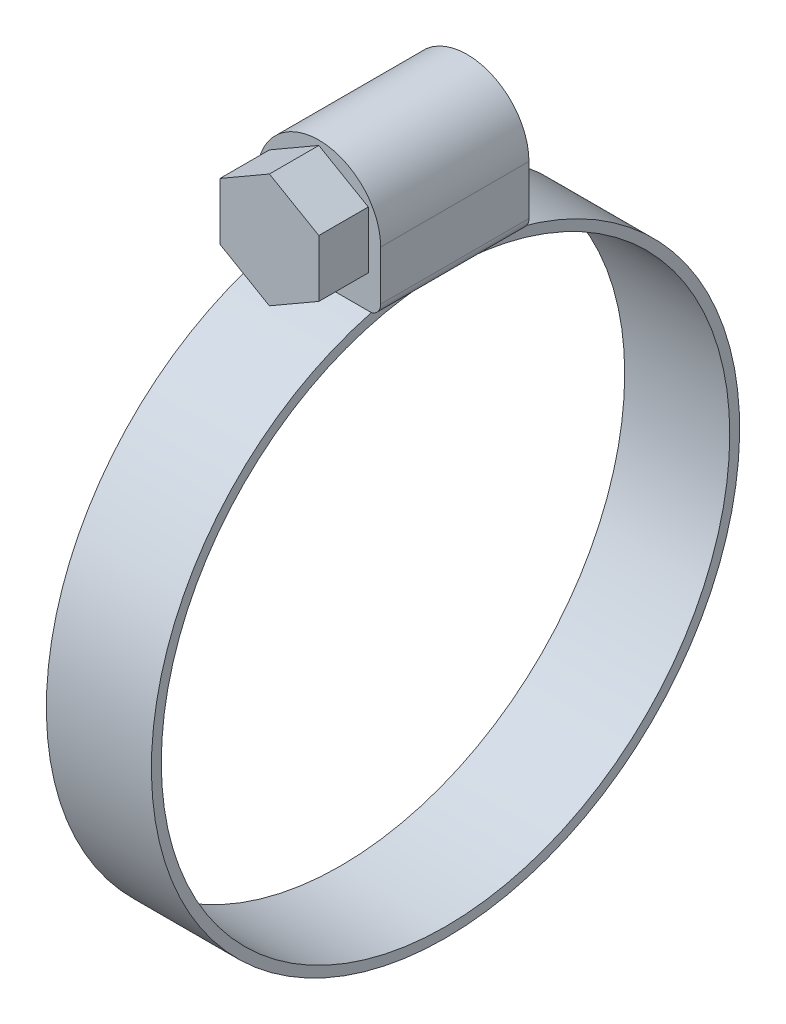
ISO-10303-21;
HEADER;
FILE_DESCRIPTION(('STEP AP214'),'2;1');
FILE_NAME('part.step','',(''),(''),'','','');
FILE_SCHEMA(('AUTOMOTIVE_DESIGN { 1 0 10303 214 1 1 1 1 }'));
ENDSEC;
DATA;
#1=APPLICATION_CONTEXT('core data for automotive mechanical design processes');
#2=APPLICATION_PROTOCOL_DEFINITION('international standard','automotive_design',2000,#1);
#3=PRODUCT_CONTEXT('',#1,'mechanical');
#4=PRODUCT('Part','Part','',(#3));
#5=PRODUCT_RELATED_PRODUCT_CATEGORY('part','',(#4));
#6=PRODUCT_DEFINITION_FORMATION('','',#4);
#7=PRODUCT_DEFINITION_CONTEXT('part definition',#1,'design');
#8=PRODUCT_DEFINITION('design','',#6,#7);
#9=PRODUCT_DEFINITION_SHAPE('','',#8);
#10=(LENGTH_UNIT() NAMED_UNIT(*) SI_UNIT(.MILLI.,.METRE.));
#11=(NAMED_UNIT(*) PLANE_ANGLE_UNIT() SI_UNIT($,.RADIAN.));
#12=(NAMED_UNIT(*) SI_UNIT($,.STERADIAN.) SOLID_ANGLE_UNIT());
#13=UNCERTAINTY_MEASURE_WITH_UNIT(LENGTH_MEASURE(1.E-05),#10,'distance_accuracy_value','');
#14=(GEOMETRIC_REPRESENTATION_CONTEXT(3) GLOBAL_UNCERTAINTY_ASSIGNED_CONTEXT((#13)) GLOBAL_UNIT_ASSIGNED_CONTEXT((#10,
#11,#12)) REPRESENTATION_CONTEXT('',''));
#15=CARTESIAN_POINT('',(0.,0.,0.));
#16=DIRECTION('',(0.,0.,1.));
#17=DIRECTION('',(1.,0.,0.));
#18=AXIS2_PLACEMENT_3D('',#15,#16,#17);
#19=CARTESIAN_POINT('',(4.24999999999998,28.,6.));
#20=DIRECTION('',(0.,0.,1.));
#21=DIRECTION('',(1.,0.,0.));
#22=AXIS2_PLACEMENT_3D('',#19,#20,#21);
#23=PLANE('',#22);
#24=DIRECTION('',(-1.,0.,0.));
#25=VECTOR('',#24,1.);
#26=CARTESIAN_POINT('',(0.,23.0312830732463,6.));
#27=LINE('',#26,#25);
#28=CARTESIAN_POINT('',(8.4981683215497,23.0312830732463,6.));
#29=VERTEX_POINT('',#28);
#30=CARTESIAN_POINT('',(0.00183167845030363,23.0312830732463,6.));
#31=VERTEX_POINT('',#30);
#32=EDGE_CURVE('E40',#29,#31,#27,.T.);
#33=ORIENTED_EDGE('',*,*,#32,.F.);
#34=CARTESIAN_POINT('',(8.24999999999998,24.,6.));
#35=DIRECTION('',(0.,0.,1.));
#36=DIRECTION('',(1.,0.,0.));
#37=AXIS2_PLACEMENT_3D('',#34,#35,#36);
#38=CIRCLE('',#37,1.);
#39=CARTESIAN_POINT('',(9.24999999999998,24.,6.));
#40=VERTEX_POINT('',#39);
#41=EDGE_CURVE('E180',#29,#40,#38,.T.);
#42=ORIENTED_EDGE('',*,*,#41,.T.);
#43=DIRECTION('',(0.,1.,0.));
#44=VECTOR('',#43,1.);
#45=CARTESIAN_POINT('',(9.24999999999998,24.,6.));
#46=LINE('',#45,#44);
#47=CARTESIAN_POINT('',(9.24999999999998,28.,6.));
#48=VERTEX_POINT('',#47);
#49=EDGE_CURVE('E182',#40,#48,#46,.T.);
#50=ORIENTED_EDGE('',*,*,#49,.T.);
#51=CARTESIAN_POINT('',(4.24999999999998,28.,6.));
#52=DIRECTION('',(0.,0.,1.));
#53=DIRECTION('',(1.,0.,0.));
#54=AXIS2_PLACEMENT_3D('',#51,#52,#53);
#55=CIRCLE('',#54,5.);
#56=CARTESIAN_POINT('',(-0.749999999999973,28.,6.));
#57=VERTEX_POINT('',#56);
#58=EDGE_CURVE('E171',#48,#57,#55,.T.);
#59=ORIENTED_EDGE('',*,*,#58,.T.);
#60=DIRECTION('',(0.,-1.,0.));
#61=VECTOR('',#60,1.);
#62=CARTESIAN_POINT('',(-0.749999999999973,28.,6.));
#63=LINE('',#62,#61);
#64=CARTESIAN_POINT('',(-0.749999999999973,24.,6.));
#65=VERTEX_POINT('',#64);
#66=EDGE_CURVE('E174',#57,#65,#63,.T.);
#67=ORIENTED_EDGE('',*,*,#66,.T.);
#68=CARTESIAN_POINT('',(0.250000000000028,24.,6.));
#69=DIRECTION('',(0.,0.,1.));
#70=DIRECTION('',(1.,0.,0.));
#71=AXIS2_PLACEMENT_3D('',#68,#69,#70);
#72=CIRCLE('',#71,1.);
#73=EDGE_CURVE('E177',#65,#31,#72,.T.);
#74=ORIENTED_EDGE('',*,*,#73,.T.);
#75=EDGE_LOOP('',(#33,#42,#50,#59,#67,#74));
#76=FACE_BOUND('',#75,.T.);
#77=DIRECTION('',(0.,1.,0.));
#78=VECTOR('',#77,1.);
#79=CARTESIAN_POINT('',(8.24999999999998,25.6905989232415,6.00000000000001));
#80=LINE('',#79,#78);
#81=CARTESIAN_POINT('',(8.24999999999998,25.6905989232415,6.00000000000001));
#82=VERTEX_POINT('',#81);
#83=CARTESIAN_POINT('',(8.24999999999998,30.3094010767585,6.00000000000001));
#84=VERTEX_POINT('',#83);
#85=EDGE_CURVE('E432',#82,#84,#80,.T.);
#86=ORIENTED_EDGE('',*,*,#85,.F.);
#87=DIRECTION('',(0.866025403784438,0.5,0.));
#88=VECTOR('',#87,1.);
#89=CARTESIAN_POINT('',(4.25000000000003,23.381197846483,6.00000000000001));
#90=LINE('',#89,#88);
#91=CARTESIAN_POINT('',(4.25000000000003,23.381197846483,6.00000000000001));
#92=VERTEX_POINT('',#91);
#93=EDGE_CURVE('E160',#92,#82,#90,.T.);
#94=ORIENTED_EDGE('',*,*,#93,.F.);
#95=DIRECTION('',(0.866025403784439,-0.5,0.));
#96=VECTOR('',#95,1.);
#97=CARTESIAN_POINT('',(0.250000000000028,25.6905989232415,6.00000000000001));
#98=LINE('',#97,#96);
#99=CARTESIAN_POINT('',(0.250000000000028,25.6905989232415,6.00000000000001));
#100=VERTEX_POINT('',#99);
#101=EDGE_CURVE('E156',#100,#92,#98,.T.);
#102=ORIENTED_EDGE('',*,*,#101,.F.);
#103=DIRECTION('',(0.,-1.,0.));
#104=VECTOR('',#103,1.);
#105=CARTESIAN_POINT('',(0.250000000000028,30.3094010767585,6.00000000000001));
#106=LINE('',#105,#104);
#107=CARTESIAN_POINT('',(0.250000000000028,30.3094010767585,6.00000000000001));
#108=VERTEX_POINT('',#107);
#109=EDGE_CURVE('E428',#108,#100,#106,.T.);
#110=ORIENTED_EDGE('',*,*,#109,.F.);
#111=DIRECTION('',(-0.866025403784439,-0.5,0.));
#112=VECTOR('',#111,1.);
#113=CARTESIAN_POINT('',(4.24999999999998,32.618802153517,6.00000000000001));
#114=LINE('',#113,#112);
#115=CARTESIAN_POINT('',(4.24999999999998,32.618802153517,6.00000000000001));
#116=VERTEX_POINT('',#115);
#117=EDGE_CURVE('E440',#116,#108,#114,.T.);
#118=ORIENTED_EDGE('',*,*,#117,.F.);
#119=DIRECTION('',(-0.866025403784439,0.5,0.));
#120=VECTOR('',#119,1.);
#121=CARTESIAN_POINT('',(8.24999999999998,30.3094010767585,6.00000000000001));
#122=LINE('',#121,#120);
#123=EDGE_CURVE('E434',#84,#116,#122,.T.);
#124=ORIENTED_EDGE('',*,*,#123,.F.);
#125=EDGE_LOOP('',(#86,#94,#102,#110,#118,#124));
#126=FACE_BOUND('',#125,.T.);
#127=ADVANCED_FACE('F36',(#76,#126),#23,.T.);
#128=CARTESIAN_POINT('',(0.,23.8,0.));
#129=DIRECTION('',(1.,0.,0.));
#130=DIRECTION('',(0.,0.,-1.));
#131=AXIS2_PLACEMENT_3D('',#128,#129,#130);
#132=PLANE('',#131);
#133=CARTESIAN_POINT('',(0.,0.,0.));
#134=DIRECTION('',(-1.,0.,0.));
#135=DIRECTION('',(0.,0.,1.));
#136=AXIS2_PLACEMENT_3D('',#133,#134,#135);
#137=CIRCLE('',#136,23.);
#138=CARTESIAN_POINT('',(0.,0.,23.));
#139=VERTEX_POINT('',#138);
#140=EDGE_CURVE('E218',#139,#139,#137,.T.);
#141=ORIENTED_EDGE('',*,*,#140,.F.);
#142=EDGE_LOOP('',(#141));
#143=FACE_BOUND('',#142,.T.);
#144=DIRECTION('',(0.,0.,-1.));
#145=VECTOR('',#144,1.);
#146=CARTESIAN_POINT('',(0.,23.0317541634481,6.));
#147=LINE('',#146,#145);
#148=CARTESIAN_POINT('',(0.,23.0317541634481,-5.99819140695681));
#149=VERTEX_POINT('',#148);
#150=CARTESIAN_POINT('',(0.,23.0317541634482,5.99819140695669));
#151=VERTEX_POINT('',#150);
#152=EDGE_CURVE('E206',#149,#151,#147,.F.);
#153=ORIENTED_EDGE('',*,*,#152,.F.);
#154=CARTESIAN_POINT('',(0.,0.,0.));
#155=DIRECTION('',(-1.,0.,0.));
#156=DIRECTION('',(0.,0.,1.));
#157=AXIS2_PLACEMENT_3D('',#154,#155,#156);
#158=CIRCLE('',#157,23.8);
#159=EDGE_CURVE('E209',#149,#151,#158,.T.);
#160=ORIENTED_EDGE('',*,*,#159,.T.);
#161=EDGE_LOOP('',(#153,#160));
#162=FACE_BOUND('',#161,.T.);
#163=ADVANCED_FACE('F38',(#143,#162),#132,.F.);
#164=CARTESIAN_POINT('',(8.50000000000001,23.8,0.));
#165=DIRECTION('',(-1.,0.,0.));
#166=DIRECTION('',(0.,0.,1.));
#167=AXIS2_PLACEMENT_3D('',#164,#165,#166);
#168=PLANE('',#167);
#169=CARTESIAN_POINT('',(8.50000000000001,0.,0.));
#170=DIRECTION('',(-1.,0.,0.));
#171=DIRECTION('',(0.,0.,1.));
#172=AXIS2_PLACEMENT_3D('',#169,#170,#171);
#173=CIRCLE('',#172,23.);
#174=CARTESIAN_POINT('',(8.50000000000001,0.,23.));
#175=VERTEX_POINT('',#174);
#176=EDGE_CURVE('E215',#175,#175,#173,.T.);
#177=ORIENTED_EDGE('',*,*,#176,.T.);
#178=EDGE_LOOP('',(#177));
#179=FACE_BOUND('',#178,.T.);
#180=DIRECTION('',(0.,0.,-1.));
#181=VECTOR('',#180,1.);
#182=CARTESIAN_POINT('',(8.50000000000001,23.0317541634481,6.));
#183=LINE('',#182,#181);
#184=CARTESIAN_POINT('',(8.50000000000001,23.0317541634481,5.9981914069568));
#185=VERTEX_POINT('',#184);
#186=CARTESIAN_POINT('',(8.50000000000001,23.0317541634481,-5.9981914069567));
#187=VERTEX_POINT('',#186);
#188=EDGE_CURVE('E203',#185,#187,#183,.T.);
#189=ORIENTED_EDGE('',*,*,#188,.F.);
#190=CARTESIAN_POINT('',(8.50000000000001,0.,0.));
#191=DIRECTION('',(-1.,0.,0.));
#192=DIRECTION('',(0.,0.,1.));
#193=AXIS2_PLACEMENT_3D('',#190,#191,#192);
#194=CIRCLE('',#193,23.8);
#195=EDGE_CURVE('E212',#187,#185,#194,.T.);
#196=ORIENTED_EDGE('',*,*,#195,.F.);
#197=EDGE_LOOP('',(#189,#196));
#198=FACE_BOUND('',#197,.T.);
#199=ADVANCED_FACE('F269',(#179,#198),#168,.F.);
#200=CARTESIAN_POINT('',(0.,0.,0.));
#201=DIRECTION('',(-1.,0.,0.));
#202=DIRECTION('',(0.,0.,1.));
#203=AXIS2_PLACEMENT_3D('',#200,#201,#202);
#204=CYLINDRICAL_SURFACE('',#203,23.8);
#205=CARTESIAN_POINT('',(0.00183167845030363,23.0312830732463,-6.));
#206=CARTESIAN_POINT('',(-0.0110917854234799,23.0345980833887,-5.98727592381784));
#207=CARTESIAN_POINT('',(-0.0234489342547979,23.0380348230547,-5.97403986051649));
#208=CARTESIAN_POINT('',(-0.0471519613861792,23.0450889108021,-5.94676996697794));
#209=CARTESIAN_POINT('',(-0.0584993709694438,23.0487059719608,-5.93273739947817));
#210=CARTESIAN_POINT('',(-0.0911464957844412,23.0597096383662,-5.88987747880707));
#211=CARTESIAN_POINT('',(-0.11118834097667,23.0672859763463,-5.86014525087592));
#212=CARTESIAN_POINT('',(-0.148399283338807,23.0825716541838,-5.79964208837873));
#213=CARTESIAN_POINT('',(-0.16560649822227,23.0902773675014,-5.7688930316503));
#214=CARTESIAN_POINT('',(-0.198057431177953,23.1058144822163,-5.70634543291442));
#215=CARTESIAN_POINT('',(-0.213297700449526,23.1136460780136,-5.67454516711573));
#216=CARTESIAN_POINT('',(-0.249474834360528,23.1333165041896,-5.59393880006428));
#217=CARTESIAN_POINT('',(-0.269385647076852,23.1451752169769,-5.54467985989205));
#218=CARTESIAN_POINT('',(-0.306412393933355,23.1688062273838,-5.44509369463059));
#219=CARTESIAN_POINT('',(-0.323526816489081,23.1805784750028,-5.39476590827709));
#220=CARTESIAN_POINT('',(-0.371585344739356,23.2156393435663,-5.24260520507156));
#221=CARTESIAN_POINT('',(-0.399215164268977,23.2386546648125,-5.13966615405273));
#222=CARTESIAN_POINT('',(-0.448929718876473,23.2840149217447,-4.93015112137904));
#223=CARTESIAN_POINT('',(-0.470894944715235,23.3063378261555,-4.82354341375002));
#224=CARTESIAN_POINT('',(-0.510195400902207,23.3496490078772,-4.60931895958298));
#225=CARTESIAN_POINT('',(-0.527534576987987,23.3706384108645,-4.50170315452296));
#226=CARTESIAN_POINT('',(-0.558542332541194,23.4110183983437,-4.28673170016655));
#227=CARTESIAN_POINT('',(-0.572244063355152,23.4304222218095,-4.17938320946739));
#228=CARTESIAN_POINT('',(-0.596913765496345,23.4678009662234,-3.96412106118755));
#229=CARTESIAN_POINT('',(-0.607881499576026,23.4857757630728,-3.85620735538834));
#230=CARTESIAN_POINT('',(-0.637529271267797,23.5375194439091,-3.53173536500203));
#231=CARTESIAN_POINT('',(-0.652943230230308,23.569092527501,-3.31452646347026));
#232=CARTESIAN_POINT('',(-0.67806862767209,23.6262985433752,-2.8786199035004));
#233=CARTESIAN_POINT('',(-0.687769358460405,23.6519202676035,-2.65992022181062));
#234=CARTESIAN_POINT('',(-0.703318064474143,23.6970894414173,-2.22180893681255));
#235=CARTESIAN_POINT('',(-0.709166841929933,23.7166381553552,-2.00239749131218));
#236=CARTESIAN_POINT('',(-0.718264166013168,23.7494987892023,-1.5649330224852));
#237=CARTESIAN_POINT('',(-0.721534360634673,23.7628622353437,-1.34688427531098));
#238=CARTESIAN_POINT('',(-0.726358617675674,23.7835818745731,-0.910470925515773));
#239=CARTESIAN_POINT('',(-0.727912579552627,23.7909377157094,-0.692106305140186));
#240=CARTESIAN_POINT('',(-0.729730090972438,23.7996295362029,-0.25547413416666));
#241=CARTESIAN_POINT('',(-0.729994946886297,23.8009716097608,-0.0372067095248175));
#242=CARTESIAN_POINT('',(-0.729315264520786,23.7976513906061,0.399268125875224));
#243=CARTESIAN_POINT('',(-0.72837080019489,23.7929894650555,0.617475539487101));
#244=CARTESIAN_POINT('',(-0.725168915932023,23.7784274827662,1.03199698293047));
#245=CARTESIAN_POINT('',(-0.723051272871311,23.7690939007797,1.22833214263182));
#246=CARTESIAN_POINT('',(-0.717166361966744,23.7455654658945,1.62072827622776));
#247=CARTESIAN_POINT('',(-0.713398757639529,23.7313696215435,1.81678918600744));
#248=CARTESIAN_POINT('',(-0.703487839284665,23.6980641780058,2.20922746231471));
#249=CARTESIAN_POINT('',(-0.697335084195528,23.6789351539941,2.405602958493));
#250=CARTESIAN_POINT('',(-0.681614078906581,23.6358276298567,2.79759055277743));
#251=CARTESIAN_POINT('',(-0.672047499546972,23.611851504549,2.99320297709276));
#252=CARTESIAN_POINT('',(-0.64794577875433,23.5589171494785,3.38477366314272));
#253=CARTESIAN_POINT('',(-0.63337867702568,23.5299274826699,3.58072587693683));
#254=CARTESIAN_POINT('',(-0.606078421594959,23.4828402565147,3.87376218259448));
#255=CARTESIAN_POINT('',(-0.596057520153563,23.4665262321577,3.97138788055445));
#256=CARTESIAN_POINT('',(-0.573780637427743,23.4327283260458,4.16617452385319));
#257=CARTESIAN_POINT('',(-0.56152489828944,23.4152445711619,4.26333551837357));
#258=CARTESIAN_POINT('',(-0.534289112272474,23.3791942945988,4.45678439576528));
#259=CARTESIAN_POINT('',(-0.519316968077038,23.3606310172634,4.55307398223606));
#260=CARTESIAN_POINT('',(-0.485904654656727,23.3224377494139,4.74483387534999));
#261=CARTESIAN_POINT('',(-0.467465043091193,23.302807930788,4.84030431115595));
#262=CARTESIAN_POINT('',(-0.426122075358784,23.2626486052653,5.02976446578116));
#263=CARTESIAN_POINT('',(-0.403232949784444,23.2421221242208,5.12375789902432));
#264=CARTESIAN_POINT('',(-0.351356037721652,23.2003136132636,5.30984947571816));
#265=CARTESIAN_POINT('',(-0.322375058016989,23.1790324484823,5.4019496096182));
#266=CARTESIAN_POINT('',(-0.275448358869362,23.1490299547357,5.52845365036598));
#267=CARTESIAN_POINT('',(-0.261321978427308,23.1404379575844,5.56430290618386));
#268=CARTESIAN_POINT('',(-0.231270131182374,23.1232553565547,5.63528105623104));
#269=CARTESIAN_POINT('',(-0.215343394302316,23.1146647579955,5.67040942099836));
#270=CARTESIAN_POINT('',(-0.181428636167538,23.0976551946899,5.73930068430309));
#271=CARTESIAN_POINT('',(-0.163460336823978,23.0892353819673,5.77307298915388));
#272=CARTESIAN_POINT('',(-0.124764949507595,23.0726403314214,5.8390426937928));
#273=CARTESIAN_POINT('',(-0.10404160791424,23.0644647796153,5.8712421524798));
#274=CARTESIAN_POINT('',(-0.0689290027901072,23.0521279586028,5.91943525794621));
#275=CARTESIAN_POINT('',(-0.0557975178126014,23.0477919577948,5.93629220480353));
#276=CARTESIAN_POINT('',(-0.0281040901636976,23.0393413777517,5.96900665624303));
#277=CARTESIAN_POINT('',(-0.013534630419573,23.0352281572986,5.98485811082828));
#278=CARTESIAN_POINT('',(0.00183167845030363,23.0312830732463,5.99999999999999));
#279=B_SPLINE_CURVE_WITH_KNOTS('',3,(#205,#206,#207,#208,#209,#210,#211,#212,#213,#214,#215,
#216,#217,#218,#219,#220,#221,#222,#223,#224,#225,#226,#227,#228,#229,#230,#231,#232,#233,#234,
#235,#236,#237,#238,#239,#240,#241,#242,#243,#244,#245,#246,#247,#248,#249,#250,#251,#252,#253,
#254,#255,#256,#257,#258,#259,#260,#261,#262,#263,#264,#265,#266,#267,#268,#269,#270,#271,#272,
#273,#274,#275,#276,#277,#278),.UNSPECIFIED.,.F.,.F.,(4,2,2,2,2,2,2,2,2,2,2,2,2,2,2,2,2,2,2,2,2,
2,2,2,2,2,2,2,2,2,2,2,2,2,2,2,4),(0.,0.0552610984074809,0.110436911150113,0.220188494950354,
0.328316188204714,0.436630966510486,0.599825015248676,0.763106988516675,1.08990715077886,
1.423123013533,1.75605374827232,2.08583702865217,2.4156489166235,3.07551946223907,
3.73662282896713,4.39758846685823,5.05294419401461,5.70833831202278,6.36306811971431,
7.0177578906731,7.60739879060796,8.19715999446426,8.78927986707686,9.38111033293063,
9.97679610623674,10.2752267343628,10.5736250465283,10.8711687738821,11.1686646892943,
11.4652243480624,11.7614543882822,11.8798548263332,11.9983393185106,12.1157634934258,
12.2330295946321,12.2983776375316,12.3640874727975),.UNSPECIFIED.);
#280=EDGE_CURVE('E11',#151,#31,#279,.T.);
#281=ORIENTED_EDGE('',*,*,#280,.F.);
#282=ORIENTED_EDGE('',*,*,#159,.F.);
#283=CARTESIAN_POINT('',(0.00183167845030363,23.0312830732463,-6.));
#284=VERTEX_POINT('',#283);
#285=EDGE_CURVE('E46',#284,#149,#279,.T.);
#286=ORIENTED_EDGE('',*,*,#285,.F.);
#287=DIRECTION('',(-1.,0.,0.));
#288=VECTOR('',#287,1.);
#289=CARTESIAN_POINT('',(0.,23.0312830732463,-6.));
#290=LINE('',#289,#288);
#291=CARTESIAN_POINT('',(8.4981683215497,23.0312830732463,-6.));
#292=VERTEX_POINT('',#291);
#293=EDGE_CURVE('E221',#292,#284,#290,.T.);
#294=ORIENTED_EDGE('',*,*,#293,.F.);
#295=CARTESIAN_POINT('',(8.4981683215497,23.0312830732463,6.));
#296=CARTESIAN_POINT('',(8.51109178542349,23.0345980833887,5.98727592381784));
#297=CARTESIAN_POINT('',(8.52344893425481,23.0380348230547,5.97403986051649));
#298=CARTESIAN_POINT('',(8.54715196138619,23.0450889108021,5.94676996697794));
#299=CARTESIAN_POINT('',(8.55849937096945,23.0487059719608,5.93273739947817));
#300=CARTESIAN_POINT('',(8.59114649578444,23.0597096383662,5.88987747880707));
#301=CARTESIAN_POINT('',(8.61118834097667,23.0672859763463,5.86014525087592));
#302=CARTESIAN_POINT('',(8.64839928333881,23.0825716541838,5.79964208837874));
#303=CARTESIAN_POINT('',(8.66560649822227,23.0902773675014,5.7688930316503));
#304=CARTESIAN_POINT('',(8.69805743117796,23.1058144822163,5.70634543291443));
#305=CARTESIAN_POINT('',(8.71329770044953,23.1136460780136,5.67454516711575));
#306=CARTESIAN_POINT('',(8.74947483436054,23.1333165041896,5.59393880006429));
#307=CARTESIAN_POINT('',(8.76938564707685,23.1451752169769,5.54467985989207));
#308=CARTESIAN_POINT('',(8.80641239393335,23.1688062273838,5.4450936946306));
#309=CARTESIAN_POINT('',(8.82352681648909,23.1805784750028,5.39476590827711));
#310=CARTESIAN_POINT('',(8.87158534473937,23.2156393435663,5.24260520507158));
#311=CARTESIAN_POINT('',(8.89921516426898,23.2386546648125,5.13966615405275));
#312=CARTESIAN_POINT('',(8.94892971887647,23.2840149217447,4.93015112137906));
#313=CARTESIAN_POINT('',(8.97089494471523,23.3063378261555,4.82354341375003));
#314=CARTESIAN_POINT('',(9.01019540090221,23.3496490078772,4.609318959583));
#315=CARTESIAN_POINT('',(9.02753457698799,23.3706384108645,4.50170315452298));
#316=CARTESIAN_POINT('',(9.0585423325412,23.4110183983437,4.28673170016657));
#317=CARTESIAN_POINT('',(9.07224406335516,23.4304222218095,4.17938320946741));
#318=CARTESIAN_POINT('',(9.09691376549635,23.4678009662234,3.96412106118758));
#319=CARTESIAN_POINT('',(9.10788149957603,23.4857757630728,3.85620735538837));
#320=CARTESIAN_POINT('',(9.13752927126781,23.5375194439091,3.53173536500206));
#321=CARTESIAN_POINT('',(9.15294323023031,23.569092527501,3.31452646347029));
#322=CARTESIAN_POINT('',(9.17806862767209,23.6262985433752,2.87861990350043));
#323=CARTESIAN_POINT('',(9.18776935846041,23.6519202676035,2.65992022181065));
#324=CARTESIAN_POINT('',(9.20331806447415,23.6970894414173,2.22180893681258));
#325=CARTESIAN_POINT('',(9.20916684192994,23.7166381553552,2.00239749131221));
#326=CARTESIAN_POINT('',(9.21826416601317,23.7494987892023,1.56493302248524));
#327=CARTESIAN_POINT('',(9.22153436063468,23.7628622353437,1.34688427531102));
#328=CARTESIAN_POINT('',(9.22635861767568,23.7835818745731,0.910470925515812));
#329=CARTESIAN_POINT('',(9.22791257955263,23.7909377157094,0.692106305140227));
#330=CARTESIAN_POINT('',(9.22973009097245,23.7996295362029,0.255474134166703));
#331=CARTESIAN_POINT('',(9.2299949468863,23.8009716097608,0.0372067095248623));
#332=CARTESIAN_POINT('',(9.22931526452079,23.7976513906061,-0.399268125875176));
#333=CARTESIAN_POINT('',(9.2283708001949,23.7929894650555,-0.617475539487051));
#334=CARTESIAN_POINT('',(9.22516891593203,23.7784274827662,-1.03199698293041));
#335=CARTESIAN_POINT('',(9.22305127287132,23.7690939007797,-1.22833214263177));
#336=CARTESIAN_POINT('',(9.21716636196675,23.7455654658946,-1.62072827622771));
#337=CARTESIAN_POINT('',(9.21339875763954,23.7313696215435,-1.8167891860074));
#338=CARTESIAN_POINT('',(9.20348783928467,23.6980641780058,-2.20922746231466));
#339=CARTESIAN_POINT('',(9.19733508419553,23.6789351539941,-2.40560295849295));
#340=CARTESIAN_POINT('',(9.18161407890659,23.6358276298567,-2.79759055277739));
#341=CARTESIAN_POINT('',(9.17204749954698,23.6118515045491,-2.99320297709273));
#342=CARTESIAN_POINT('',(9.14794577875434,23.5589171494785,-3.38477366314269));
#343=CARTESIAN_POINT('',(9.13337867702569,23.52992748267,-3.5807258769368));
#344=CARTESIAN_POINT('',(9.10607842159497,23.4828402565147,-3.87376218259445));
#345=CARTESIAN_POINT('',(9.09605752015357,23.4665262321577,-3.97138788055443));
#346=CARTESIAN_POINT('',(9.07378063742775,23.4327283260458,-4.16617452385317));
#347=CARTESIAN_POINT('',(9.06152489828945,23.4152445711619,-4.26333551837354));
#348=CARTESIAN_POINT('',(9.03428911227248,23.3791942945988,-4.45678439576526));
#349=CARTESIAN_POINT('',(9.01931696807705,23.3606310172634,-4.55307398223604));
#350=CARTESIAN_POINT('',(8.98590465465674,23.322437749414,-4.74483387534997));
#351=CARTESIAN_POINT('',(8.96746504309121,23.302807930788,-4.84030431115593));
#352=CARTESIAN_POINT('',(8.9261220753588,23.2626486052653,-5.02976446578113));
#353=CARTESIAN_POINT('',(8.90323294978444,23.2421221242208,-5.12375789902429));
#354=CARTESIAN_POINT('',(8.85135603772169,23.2003136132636,-5.30984947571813));
#355=CARTESIAN_POINT('',(8.82237505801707,23.1790324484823,-5.40194960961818));
#356=CARTESIAN_POINT('',(8.77544835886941,23.1490299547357,-5.52845365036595));
#357=CARTESIAN_POINT('',(8.76132197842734,23.1404379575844,-5.56430290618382));
#358=CARTESIAN_POINT('',(8.73127013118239,23.1232553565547,-5.63528105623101));
#359=CARTESIAN_POINT('',(8.71534339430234,23.1146647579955,-5.67040942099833));
#360=CARTESIAN_POINT('',(8.68142863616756,23.09765519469,-5.73930068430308));
#361=CARTESIAN_POINT('',(8.663460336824,23.0892353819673,-5.77307298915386));
#362=CARTESIAN_POINT('',(8.62476494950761,23.0726403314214,-5.83904269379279));
#363=CARTESIAN_POINT('',(8.60404160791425,23.0644647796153,-5.8712421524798));
#364=CARTESIAN_POINT('',(8.56892900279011,23.0521279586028,-5.91943525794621));
#365=CARTESIAN_POINT('',(8.55579751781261,23.0477919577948,-5.93629220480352));
#366=CARTESIAN_POINT('',(8.5281040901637,23.0393413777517,-5.96900665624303));
#367=CARTESIAN_POINT('',(8.51353463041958,23.0352281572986,-5.98485811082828));
#368=CARTESIAN_POINT('',(8.4981683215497,23.0312830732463,-6.));
#369=B_SPLINE_CURVE_WITH_KNOTS('',3,(#295,#296,#297,#298,#299,#300,#301,#302,#303,#304,#305,
#306,#307,#308,#309,#310,#311,#312,#313,#314,#315,#316,#317,#318,#319,#320,#321,#322,#323,#324,
#325,#326,#327,#328,#329,#330,#331,#332,#333,#334,#335,#336,#337,#338,#339,#340,#341,#342,#343,
#344,#345,#346,#347,#348,#349,#350,#351,#352,#353,#354,#355,#356,#357,#358,#359,#360,#361,#362,
#363,#364,#365,#366,#367,#368),.UNSPECIFIED.,.F.,.F.,(4,2,2,2,2,2,2,2,2,2,2,2,2,2,2,2,2,2,2,2,2,
2,2,2,2,2,2,2,2,2,2,2,2,2,2,2,4),(0.,0.0552610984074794,0.110436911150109,0.220188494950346,
0.328316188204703,0.436630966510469,0.599825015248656,0.763106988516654,1.08990715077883,
1.42312301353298,1.75605374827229,2.08583702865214,2.41564891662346,3.07551946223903,
3.73662282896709,4.39758846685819,5.05294419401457,5.70833831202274,6.36306811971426,
7.01775789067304,7.6073987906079,8.19715999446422,8.78927986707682,9.38111033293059,
9.9767961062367,10.2752267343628,10.5736250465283,10.8711687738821,11.1686646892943,
11.4652243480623,11.7614543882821,11.8798548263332,11.9983393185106,12.1157634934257,
12.2330295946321,12.2983776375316,12.3640874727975),.UNSPECIFIED.);
#370=EDGE_CURVE('E224',#187,#292,#369,.T.);
#371=ORIENTED_EDGE('',*,*,#370,.F.);
#372=ORIENTED_EDGE('',*,*,#195,.T.);
#373=EDGE_CURVE('E45',#29,#185,#369,.T.);
#374=ORIENTED_EDGE('',*,*,#373,.F.);
#375=ORIENTED_EDGE('',*,*,#32,.T.);
#376=EDGE_LOOP('',(#281,#282,#286,#294,#371,#372,#374,#375));
#377=FACE_BOUND('',#376,.T.);
#378=ADVANCED_FACE('F235',(#377),#204,.T.);
#379=CARTESIAN_POINT('',(0.,0.,0.));
#380=DIRECTION('',(-1.,0.,0.));
#381=DIRECTION('',(0.,0.,1.));
#382=AXIS2_PLACEMENT_3D('',#379,#380,#381);
#383=CYLINDRICAL_SURFACE('',#382,23.);
#384=ORIENTED_EDGE('',*,*,#176,.F.);
#385=EDGE_LOOP('',(#384));
#386=FACE_BOUND('',#385,.T.);
#387=ORIENTED_EDGE('',*,*,#140,.T.);
#388=EDGE_LOOP('',(#387));
#389=FACE_BOUND('',#388,.T.);
#390=ADVANCED_FACE('F251',(#386,#389),#383,.F.);
#391=CARTESIAN_POINT('',(0.250000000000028,24.,6.));
#392=DIRECTION('',(0.,0.,-1.));
#393=DIRECTION('',(-1.,0.,0.));
#394=AXIS2_PLACEMENT_3D('',#391,#392,#393);
#395=CYLINDRICAL_SURFACE('',#394,1.);
#396=CARTESIAN_POINT('',(0.250000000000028,24.,-6.));
#397=DIRECTION('',(0.,0.,1.));
#398=DIRECTION('',(1.,0.,0.));
#399=AXIS2_PLACEMENT_3D('',#396,#397,#398);
#400=CIRCLE('',#399,1.);
#401=CARTESIAN_POINT('',(-0.749999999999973,24.,-6.));
#402=VERTEX_POINT('',#401);
#403=EDGE_CURVE('E186',#402,#284,#400,.T.);
#404=ORIENTED_EDGE('',*,*,#403,.T.);
#405=ORIENTED_EDGE('',*,*,#285,.T.);
#406=ORIENTED_EDGE('',*,*,#152,.T.);
#407=ORIENTED_EDGE('',*,*,#280,.T.);
#408=ORIENTED_EDGE('',*,*,#73,.F.);
#409=DIRECTION('',(0.,0.,-1.));
#410=VECTOR('',#409,1.);
#411=CARTESIAN_POINT('',(-0.749999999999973,24.,6.));
#412=LINE('',#411,#410);
#413=EDGE_CURVE('E197',#65,#402,#412,.T.);
#414=ORIENTED_EDGE('',*,*,#413,.T.);
#415=EDGE_LOOP('',(#404,#405,#406,#407,#408,#414));
#416=FACE_BOUND('',#415,.T.);
#417=ADVANCED_FACE('F244',(#416),#395,.T.);
#418=CARTESIAN_POINT('',(8.24999999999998,24.,6.));
#419=DIRECTION('',(0.,0.,-1.));
#420=DIRECTION('',(-1.,0.,0.));
#421=AXIS2_PLACEMENT_3D('',#418,#419,#420);
#422=CYLINDRICAL_SURFACE('',#421,1.);
#423=ORIENTED_EDGE('',*,*,#41,.F.);
#424=ORIENTED_EDGE('',*,*,#373,.T.);
#425=ORIENTED_EDGE('',*,*,#188,.T.);
#426=ORIENTED_EDGE('',*,*,#370,.T.);
#427=CARTESIAN_POINT('',(8.24999999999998,24.,-6.));
#428=DIRECTION('',(0.,0.,1.));
#429=DIRECTION('',(1.,0.,0.));
#430=AXIS2_PLACEMENT_3D('',#427,#428,#429);
#431=CIRCLE('',#430,1.);
#432=CARTESIAN_POINT('',(9.24999999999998,24.,-6.));
#433=VERTEX_POINT('',#432);
#434=EDGE_CURVE('E189',#292,#433,#431,.T.);
#435=ORIENTED_EDGE('',*,*,#434,.T.);
#436=DIRECTION('',(0.,0.,-1.));
#437=VECTOR('',#436,1.);
#438=CARTESIAN_POINT('',(9.24999999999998,24.,6.));
#439=LINE('',#438,#437);
#440=EDGE_CURVE('E194',#40,#433,#439,.T.);
#441=ORIENTED_EDGE('',*,*,#440,.F.);
#442=EDGE_LOOP('',(#423,#424,#425,#426,#435,#441));
#443=FACE_BOUND('',#442,.T.);
#444=ADVANCED_FACE('F239',(#443),#422,.T.);
#445=CARTESIAN_POINT('',(4.24999999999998,28.,-6.));
#446=DIRECTION('',(0.,0.,1.));
#447=DIRECTION('',(1.,0.,0.));
#448=AXIS2_PLACEMENT_3D('',#445,#446,#447);
#449=PLANE('',#448);
#450=ORIENTED_EDGE('',*,*,#434,.F.);
#451=ORIENTED_EDGE('',*,*,#293,.T.);
#452=ORIENTED_EDGE('',*,*,#403,.F.);
#453=DIRECTION('',(0.,-1.,0.));
#454=VECTOR('',#453,1.);
#455=CARTESIAN_POINT('',(-0.749999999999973,28.,-6.));
#456=LINE('',#455,#454);
#457=CARTESIAN_POINT('',(-0.749999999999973,28.,-6.));
#458=VERTEX_POINT('',#457);
#459=EDGE_CURVE('E165',#458,#402,#456,.T.);
#460=ORIENTED_EDGE('',*,*,#459,.F.);
#461=CARTESIAN_POINT('',(4.24999999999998,28.,-6.));
#462=DIRECTION('',(0.,0.,1.));
#463=DIRECTION('',(1.,0.,0.));
#464=AXIS2_PLACEMENT_3D('',#461,#462,#463);
#465=CIRCLE('',#464,5.);
#466=CARTESIAN_POINT('',(9.24999999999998,28.,-6.));
#467=VERTEX_POINT('',#466);
#468=EDGE_CURVE('E162',#467,#458,#465,.T.);
#469=ORIENTED_EDGE('',*,*,#468,.F.);
#470=DIRECTION('',(0.,1.,0.));
#471=VECTOR('',#470,1.);
#472=CARTESIAN_POINT('',(9.24999999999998,24.,-6.));
#473=LINE('',#472,#471);
#474=EDGE_CURVE('E175',#433,#467,#473,.T.);
#475=ORIENTED_EDGE('',*,*,#474,.F.);
#476=EDGE_LOOP('',(#450,#451,#452,#460,#469,#475));
#477=FACE_BOUND('',#476,.T.);
#478=ADVANCED_FACE('F243',(#477),#449,.F.);
#479=CARTESIAN_POINT('',(4.24999999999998,28.,6.));
#480=DIRECTION('',(0.,0.,-1.));
#481=DIRECTION('',(-1.,0.,0.));
#482=AXIS2_PLACEMENT_3D('',#479,#480,#481);
#483=CYLINDRICAL_SURFACE('',#482,5.);
#484=ORIENTED_EDGE('',*,*,#468,.T.);
#485=DIRECTION('',(0.,0.,-1.));
#486=VECTOR('',#485,1.);
#487=CARTESIAN_POINT('',(-0.749999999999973,28.,6.));
#488=LINE('',#487,#486);
#489=EDGE_CURVE('E200',#57,#458,#488,.T.);
#490=ORIENTED_EDGE('',*,*,#489,.F.);
#491=ORIENTED_EDGE('',*,*,#58,.F.);
#492=DIRECTION('',(0.,0.,-1.));
#493=VECTOR('',#492,1.);
#494=CARTESIAN_POINT('',(9.24999999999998,28.,6.));
#495=LINE('',#494,#493);
#496=EDGE_CURVE('E183',#48,#467,#495,.T.);
#497=ORIENTED_EDGE('',*,*,#496,.T.);
#498=EDGE_LOOP('',(#484,#490,#491,#497));
#499=FACE_BOUND('',#498,.T.);
#500=ADVANCED_FACE('F255',(#499),#483,.T.);
#501=CARTESIAN_POINT('',(-0.749999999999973,28.,6.));
#502=DIRECTION('',(1.,0.,0.));
#503=DIRECTION('',(0.,1.,0.));
#504=AXIS2_PLACEMENT_3D('',#501,#502,#503);
#505=PLANE('',#504);
#506=ORIENTED_EDGE('',*,*,#459,.T.);
#507=ORIENTED_EDGE('',*,*,#413,.F.);
#508=ORIENTED_EDGE('',*,*,#66,.F.);
#509=ORIENTED_EDGE('',*,*,#489,.T.);
#510=EDGE_LOOP('',(#506,#507,#508,#509));
#511=FACE_BOUND('',#510,.T.);
#512=ADVANCED_FACE('F253',(#511),#505,.F.);
#513=CARTESIAN_POINT('',(9.24999999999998,24.,6.));
#514=DIRECTION('',(-1.,0.,0.));
#515=DIRECTION('',(0.,0.,1.));
#516=AXIS2_PLACEMENT_3D('',#513,#514,#515);
#517=PLANE('',#516);
#518=ORIENTED_EDGE('',*,*,#474,.T.);
#519=ORIENTED_EDGE('',*,*,#496,.F.);
#520=ORIENTED_EDGE('',*,*,#49,.F.);
#521=ORIENTED_EDGE('',*,*,#440,.T.);
#522=EDGE_LOOP('',(#518,#519,#520,#521));
#523=FACE_BOUND('',#522,.T.);
#524=ADVANCED_FACE('F246',(#523),#517,.F.);
#525=CARTESIAN_POINT('',(4.25000000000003,23.381197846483,9.99999999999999));
#526=DIRECTION('',(-0.5,0.866025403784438,0.));
#527=DIRECTION('',(-0.866025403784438,-0.5,0.));
#528=AXIS2_PLACEMENT_3D('',#525,#526,#527);
#529=PLANE('',#528);
#530=ORIENTED_EDGE('',*,*,#93,.T.);
#531=DIRECTION('',(0.,0.,-1.));
#532=VECTOR('',#531,1.);
#533=CARTESIAN_POINT('',(8.24999999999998,25.6905989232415,9.99999999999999));
#534=LINE('',#533,#532);
#535=CARTESIAN_POINT('',(8.24999999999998,25.6905989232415,9.99999999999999));
#536=VERTEX_POINT('',#535);
#537=EDGE_CURVE('E141',#536,#82,#534,.T.);
#538=ORIENTED_EDGE('',*,*,#537,.F.);
#539=DIRECTION('',(0.866025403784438,0.5,0.));
#540=VECTOR('',#539,1.);
#541=CARTESIAN_POINT('',(4.25000000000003,23.381197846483,9.99999999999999));
#542=LINE('',#541,#540);
#543=CARTESIAN_POINT('',(4.25000000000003,23.381197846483,9.99999999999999));
#544=VERTEX_POINT('',#543);
#545=EDGE_CURVE('E148',#544,#536,#542,.T.);
#546=ORIENTED_EDGE('',*,*,#545,.F.);
#547=DIRECTION('',(0.,0.,-1.));
#548=VECTOR('',#547,1.);
#549=CARTESIAN_POINT('',(4.25000000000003,23.381197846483,9.99999999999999));
#550=LINE('',#549,#548);
#551=EDGE_CURVE('E426',#544,#92,#550,.T.);
#552=ORIENTED_EDGE('',*,*,#551,.T.);
#553=EDGE_LOOP('',(#530,#538,#546,#552));
#554=FACE_BOUND('',#553,.T.);
#555=ADVANCED_FACE('F158',(#554),#529,.F.);
#556=CARTESIAN_POINT('',(8.24999999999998,25.6905989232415,9.99999999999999));
#557=DIRECTION('',(-1.,0.,0.));
#558=DIRECTION('',(0.,-1.,0.));
#559=AXIS2_PLACEMENT_3D('',#556,#557,#558);
#560=PLANE('',#559);
#561=ORIENTED_EDGE('',*,*,#85,.T.);
#562=DIRECTION('',(0.,0.,-1.));
#563=VECTOR('',#562,1.);
#564=CARTESIAN_POINT('',(8.24999999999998,30.3094010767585,9.99999999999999));
#565=LINE('',#564,#563);
#566=CARTESIAN_POINT('',(8.24999999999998,30.3094010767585,9.99999999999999));
#567=VERTEX_POINT('',#566);
#568=EDGE_CURVE('E144',#567,#84,#565,.T.);
#569=ORIENTED_EDGE('',*,*,#568,.F.);
#570=DIRECTION('',(0.,1.,0.));
#571=VECTOR('',#570,1.);
#572=CARTESIAN_POINT('',(8.24999999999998,25.6905989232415,9.99999999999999));
#573=LINE('',#572,#571);
#574=EDGE_CURVE('E137',#536,#567,#573,.T.);
#575=ORIENTED_EDGE('',*,*,#574,.F.);
#576=ORIENTED_EDGE('',*,*,#537,.T.);
#577=EDGE_LOOP('',(#561,#569,#575,#576));
#578=FACE_BOUND('',#577,.T.);
#579=ADVANCED_FACE('F139',(#578),#560,.F.);
#580=CARTESIAN_POINT('',(8.24999999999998,30.3094010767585,9.99999999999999));
#581=DIRECTION('',(-0.5,-0.866025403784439,0.));
#582=DIRECTION('',(0.866025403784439,-0.5,0.));
#583=AXIS2_PLACEMENT_3D('',#580,#581,#582);
#584=PLANE('',#583);
#585=ORIENTED_EDGE('',*,*,#123,.T.);
#586=DIRECTION('',(0.,0.,-1.));
#587=VECTOR('',#586,1.);
#588=CARTESIAN_POINT('',(4.24999999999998,32.618802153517,9.99999999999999));
#589=LINE('',#588,#587);
#590=CARTESIAN_POINT('',(4.24999999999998,32.618802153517,9.99999999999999));
#591=VERTEX_POINT('',#590);
#592=EDGE_CURVE('E167',#591,#116,#589,.T.);
#593=ORIENTED_EDGE('',*,*,#592,.F.);
#594=DIRECTION('',(-0.866025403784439,0.5,0.));
#595=VECTOR('',#594,1.);
#596=CARTESIAN_POINT('',(8.24999999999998,30.3094010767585,9.99999999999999));
#597=LINE('',#596,#595);
#598=EDGE_CURVE('E147',#567,#591,#597,.T.);
#599=ORIENTED_EDGE('',*,*,#598,.F.);
#600=ORIENTED_EDGE('',*,*,#568,.T.);
#601=EDGE_LOOP('',(#585,#593,#599,#600));
#602=FACE_BOUND('',#601,.T.);
#603=ADVANCED_FACE('F277',(#602),#584,.F.);
#604=CARTESIAN_POINT('',(4.24999999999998,32.618802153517,9.99999999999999));
#605=DIRECTION('',(0.5,-0.866025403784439,0.));
#606=DIRECTION('',(0.866025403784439,0.5,0.));
#607=AXIS2_PLACEMENT_3D('',#604,#605,#606);
#608=PLANE('',#607);
#609=ORIENTED_EDGE('',*,*,#117,.T.);
#610=DIRECTION('',(0.,0.,-1.));
#611=VECTOR('',#610,1.);
#612=CARTESIAN_POINT('',(0.250000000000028,30.3094010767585,9.99999999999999));
#613=LINE('',#612,#611);
#614=CARTESIAN_POINT('',(0.250000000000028,30.3094010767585,9.99999999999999));
#615=VERTEX_POINT('',#614);
#616=EDGE_CURVE('E444',#615,#108,#613,.T.);
#617=ORIENTED_EDGE('',*,*,#616,.F.);
#618=DIRECTION('',(-0.866025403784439,-0.5,0.));
#619=VECTOR('',#618,1.);
#620=CARTESIAN_POINT('',(4.24999999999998,32.618802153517,9.99999999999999));
#621=LINE('',#620,#619);
#622=EDGE_CURVE('E451',#591,#615,#621,.T.);
#623=ORIENTED_EDGE('',*,*,#622,.F.);
#624=ORIENTED_EDGE('',*,*,#592,.T.);
#625=EDGE_LOOP('',(#609,#617,#623,#624));
#626=FACE_BOUND('',#625,.T.);
#627=ADVANCED_FACE('F280',(#626),#608,.F.);
#628=CARTESIAN_POINT('',(0.250000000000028,30.3094010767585,9.99999999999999));
#629=DIRECTION('',(1.,0.,0.));
#630=DIRECTION('',(0.,1.,0.));
#631=AXIS2_PLACEMENT_3D('',#628,#629,#630);
#632=PLANE('',#631);
#633=ORIENTED_EDGE('',*,*,#109,.T.);
#634=DIRECTION('',(0.,0.,-1.));
#635=VECTOR('',#634,1.);
#636=CARTESIAN_POINT('',(0.250000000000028,25.6905989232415,9.99999999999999));
#637=LINE('',#636,#635);
#638=CARTESIAN_POINT('',(0.250000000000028,25.6905989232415,9.99999999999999));
#639=VERTEX_POINT('',#638);
#640=EDGE_CURVE('E53',#639,#100,#637,.T.);
#641=ORIENTED_EDGE('',*,*,#640,.F.);
#642=DIRECTION('',(0.,-1.,0.));
#643=VECTOR('',#642,1.);
#644=CARTESIAN_POINT('',(0.250000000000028,30.3094010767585,9.99999999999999));
#645=LINE('',#644,#643);
#646=EDGE_CURVE('E453',#615,#639,#645,.T.);
#647=ORIENTED_EDGE('',*,*,#646,.F.);
#648=ORIENTED_EDGE('',*,*,#616,.T.);
#649=EDGE_LOOP('',(#633,#641,#647,#648));
#650=FACE_BOUND('',#649,.T.);
#651=ADVANCED_FACE('F284',(#650),#632,.F.);
#652=CARTESIAN_POINT('',(0.250000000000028,25.6905989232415,9.99999999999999));
#653=DIRECTION('',(0.5,0.866025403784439,0.));
#654=DIRECTION('',(-0.866025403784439,0.5,0.));
#655=AXIS2_PLACEMENT_3D('',#652,#653,#654);
#656=PLANE('',#655);
#657=ORIENTED_EDGE('',*,*,#101,.T.);
#658=ORIENTED_EDGE('',*,*,#551,.F.);
#659=DIRECTION('',(0.866025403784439,-0.5,0.));
#660=VECTOR('',#659,1.);
#661=CARTESIAN_POINT('',(0.250000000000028,25.6905989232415,9.99999999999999));
#662=LINE('',#661,#660);
#663=EDGE_CURVE('E152',#639,#544,#662,.T.);
#664=ORIENTED_EDGE('',*,*,#663,.F.);
#665=ORIENTED_EDGE('',*,*,#640,.T.);
#666=EDGE_LOOP('',(#657,#658,#664,#665));
#667=FACE_BOUND('',#666,.T.);
#668=ADVANCED_FACE('F288',(#667),#656,.F.);
#669=CARTESIAN_POINT('',(0.,0.,9.99999999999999));
#670=DIRECTION('',(0.,0.,1.));
#671=DIRECTION('',(1.,0.,0.));
#672=AXIS2_PLACEMENT_3D('',#669,#670,#671);
#673=PLANE('',#672);
#674=ORIENTED_EDGE('',*,*,#545,.T.);
#675=ORIENTED_EDGE('',*,*,#574,.T.);
#676=ORIENTED_EDGE('',*,*,#598,.T.);
#677=ORIENTED_EDGE('',*,*,#622,.T.);
#678=ORIENTED_EDGE('',*,*,#646,.T.);
#679=ORIENTED_EDGE('',*,*,#663,.T.);
#680=EDGE_LOOP('',(#674,#675,#676,#677,#678,#679));
#681=FACE_BOUND('',#680,.T.);
#682=ADVANCED_FACE('F151',(#681),#673,.T.);
#683=CLOSED_SHELL('',(#127,#163,#199,#378,#390,#417,#444,#478,#500,#512,#524,#555,#579,#603,
#627,#651,#668,#682));
#684=MANIFOLD_SOLID_BREP('B2',#683);
#685=ADVANCED_BREP_SHAPE_REPRESENTATION('',(#18,#684),#14);
#686=SHAPE_DEFINITION_REPRESENTATION(#9,#685);
ENDSEC;
END-ISO-10303-21;
